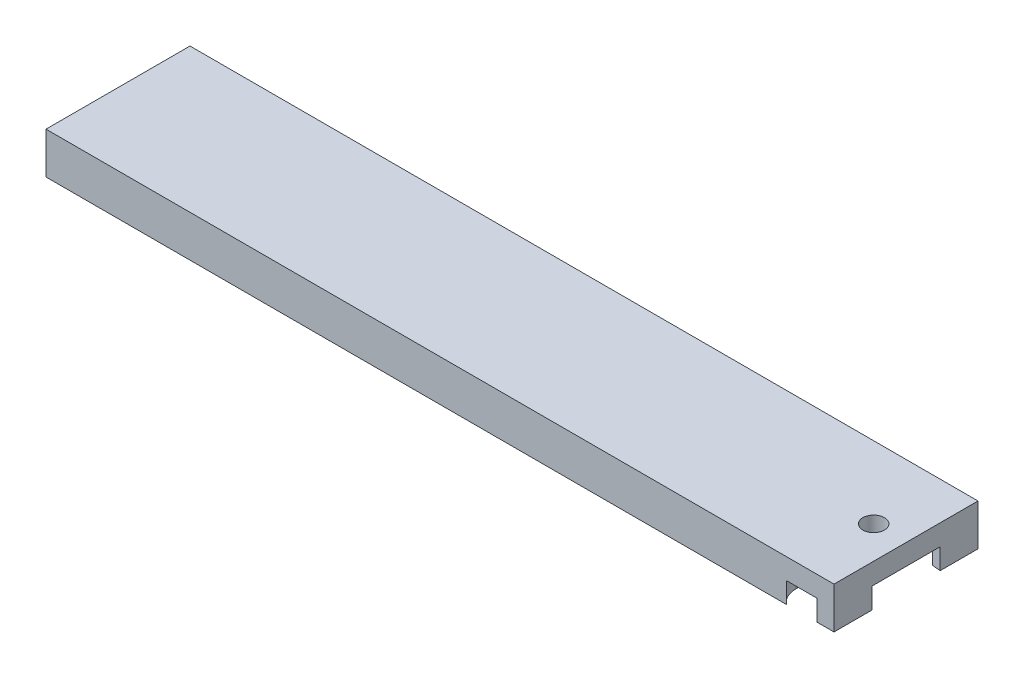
from build123d import *

# Parameters (mm, degrees)
RESSALTO_EXTRUS_O1_DEPTH = 1.4
ESBO_O2_R                = 3.45
RESSALTO_EXTRUS_O2_DEPTH = 2.4
FURO1_D                  = 1.2
PADR_O_LINEAR1_COUNT     = 6
PADR_O_LINEAR1_PITCH     = 2
RESSALTO_EXTRUS_O3_DEPTH = 1.4
FURO2_D                  = 1.2
PADR_O_LINEAR2_COUNT     = 7
PADR_O_LINEAR2_PITCH     = 2
RESSALTO_EXTRUS_O4_DEPTH = 1.4
FURO3_D                  = 1.2
PADR_O_LINEAR3_COUNT     = 2
PADR_O_LINEAR3_PITCH     = 2
PADR_OCIRCULAR1_COUNT    = 2
PADR_OCIRCULAR1_COPY_1_D = 1.2
FURO4_D                  = 4.95
FURO4_DEPTH              = 2
FURO5_D                  = 4.6
FURO5_DEPTH              = 1
FURO6_D                  = 2.1
RESSALTO_EXTRUS_O5_START = -2
RESSALTO_EXTRUS_O5_DEPTH = 2
PADR_OCIRCULAR2_COUNT    = 60
BOSS_EXTRUDE1_DEPTH      = 5
BOSS_EXTRUDE1_2_DEPTH    = 5
BOSS_EXTRUDE1_3_DEPTH    = 5
SKETCH2_W                = 100
SKETCH2_H                = 17.359649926
BOSS_EXTRUDE2_DEPTH      = 2.5
SKETCH3_R                = 1.3
CUT_EXTRUDE1_DEPTH       = 92.764859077
SKETCH4_W                = 52.17150673
SKETCH4_H                = 37.712890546
CUT_EXTRUDE2_DEPTH       = 92.649055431
CUT_EXTRUDE3_DEPTH       = 2.5
SKETCH6_W                = 5
SKETCH6_H                = 17.359649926
CUT_EXTRUDE5_DEPTH       = 10


with BuildPart() as part:
    # Esbo_o1 → Ressalto-extrus_o1 (new body)
    with BuildSketch(Plane(origin=(0, 0, 0), x_dir=(1, 0, 0), z_dir=(0, 1, 0))):
        with BuildLine():
            Line((-14.159121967, 1.99702088), (-2.209072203, 2.65))
            ThreePointArc((-2.209072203, 2.65), (3.45, 0), (-2.209072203, -2.65))
            Line((-2.209072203, -2.65), (-14.159121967, -1.99702088))
            ThreePointArc((-14.159121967, -1.99702088), (-16.05, 0), (-14.159121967, 1.99702088))
        make_face()
    extrude(amount=-RESSALTO_EXTRUS_O1_DEPTH)

    # Esbo_o2 → Ressalto-extrus_o2 (add)
    with BuildSketch(Plane.XZ.offset(1.4)):
        with Locations(Location((0, 0, 0), (0, 0, 90))):
            Circle(ESBO_O2_R)
    extrude(amount=RESSALTO_EXTRUS_O2_DEPTH)

    # Furo1 (through all)
    with Locations(Plane(origin=(0, 0, 0), x_dir=(1, 0, 0), z_dir=(0, 1, 0))):
        with Locations((-14.45, 0)):
            furo1 = Hole(FURO1_D / 2)

    # Padr_o linear1: Furo1 ×6
    with Locations(*[(i * PADR_O_LINEAR1_PITCH, 0, 0) for i in range(1, PADR_O_LINEAR1_COUNT)]):
        add(furo1, mode=Mode.SUBTRACT)

    # Esbo_o12 → Ressalto-extrus_o3 (add)
    with BuildSketch(Plane(origin=(0, 0, 0), x_dir=(1, 0, 0), z_dir=(0, 1, 0))):
        with BuildLine():
            Line((0.304103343, 3.436571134), (16.626291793, 1.99221515))
            ThreePointArc((16.626291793, 1.99221515), (18.45, 0), (16.626291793, -1.99221515))
            Line((16.626291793, -1.99221515), (0.304103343, -3.436571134))
            ThreePointArc((0.304103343, -3.436571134), (3.45, 0), (0.304103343, 3.436571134))
        make_face()
    extrude(amount=-RESSALTO_EXTRUS_O3_DEPTH)

    # Furo2 (through all)
    with Locations(Plane(origin=(0, 0, 0), x_dir=(1, 0, 0), z_dir=(0, 1, 0))):
        with Locations((16.85, 0)):
            furo2 = Hole(FURO2_D / 2)

    # Padr_o linear2: Furo2 ×7
    with Locations(*[(-i * PADR_O_LINEAR2_PITCH, 0, 0) for i in range(1, PADR_O_LINEAR2_COUNT)]):
        add(furo2, mode=Mode.SUBTRACT)

    # Esbo_o16 → Ressalto-extrus_o4 (add)
    with BuildSketch(Plane(origin=(0, 0, 0), x_dir=(1, 0, 0), z_dir=(0, 1, 0))):
        with BuildLine():
            Line((-1.9, -6.45), (-1.9, 6.45))
            ThreePointArc((-1.9, 6.45), (0, 8.35), (1.9, 6.45))
            Line((1.9, 6.45), (1.9, -6.45))
            ThreePointArc((1.9, -6.45), (0, -8.35), (-1.9, -6.45))
        make_face()
    extrude(amount=-RESSALTO_EXTRUS_O4_DEPTH)

    # Furo3 (through all)
    with Locations(Plane(origin=(0, 0, 0), x_dir=(1, 0, 0), z_dir=(0, 1, 0))):
        with Locations((0, -6.45)):
            furo3 = Hole(FURO3_D / 2)

    # Padr_o linear3: Furo3 ×2
    with Locations(*[(0, 0, -i * PADR_O_LINEAR3_PITCH) for i in range(1, PADR_O_LINEAR3_COUNT)]):
        add(furo3, mode=Mode.SUBTRACT)

    # Padr_oCircular1: Furo3 ×2 about axis
    padr_ocircular1_axis = Axis((0, 0, 0), (0, 1, 0))
    for i in range(1, PADR_OCIRCULAR1_COUNT):
        add(furo3.rotate(padr_ocircular1_axis, i * 360 / PADR_OCIRCULAR1_COUNT), mode=Mode.SUBTRACT)

    # Padr_oCircular1 copy 1 (through all)
    with Locations(Plane(origin=(0, 0, 2), x_dir=(-1, 0, 0), z_dir=(0, 1, 0))):
        with Locations((0, -6.45)):
            Hole(PADR_OCIRCULAR1_COPY_1_D / 2)

    # Furo4
    with Locations(Plane(origin=(0, -3.8, 0), x_dir=(-1, 0, 0), z_dir=(0, -1, 0))):
        with Locations((0, 0)):
            Hole(FURO4_D / 2, depth=FURO4_DEPTH)

    # Furo5
    with Locations(Plane(origin=(0, 0, 0), x_dir=(1, 0, 0), z_dir=(0, 1, 0))):
        with Locations((0, 0)):
            Hole(FURO5_D / 2, depth=FURO5_DEPTH)

    # Furo6 (through all)
    with Locations(Plane(origin=(0, 0, 0), x_dir=(1, 0, 0), z_dir=(0, 1, 0))):
        with Locations((0, 0)):
            Hole(FURO6_D / 2)

    # Esbo_o11 → Ressalto-extrus_o5 (add)
    with BuildSketch(Plane.XZ.offset(3.8).offset(RESSALTO_EXTRUS_O5_START)):
        with BuildLine():
            Line((-0.098056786, 2.473056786), (0, 2.375))
            Line((0, 2.375), (0.098056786, 2.473056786))
            ThreePointArc((0.098056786, 2.473056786), (0, 2.475), (-0.098056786, 2.473056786))
        make_face()
    ressalto_extrus_o5 = extrude(amount=RESSALTO_EXTRUS_O5_DEPTH)

    # Padr_oCircular2: Ressalto-extrus_o5 ×60 about axis
    padr_ocircular2_axis = Axis((0, 0, 0), (0, 1, 0))
    for i in range(1, PADR_OCIRCULAR2_COUNT):
        add(ressalto_extrus_o5.rotate(padr_ocircular2_axis, i * 360 / PADR_OCIRCULAR2_COUNT))


with BuildPart() as body_2:
    # Sketch1 → Boss-Extrude1 (new body)
    with BuildSketch(Plane(origin=(0, 0, 0), x_dir=(1, 0, 0), z_dir=(0, 1, 0))):
        with BuildLine():
            ThreePointArc((-2.9, 6.45), (-2.625551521, 7.681454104), (-1.854152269, 8.679824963))
            Line((-1.854152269, 8.679824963), (-91.1, 8.679824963))
            Line((-91.1, 8.679824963), (-91.1, -8.679824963))
            Line((-91.1, -8.679824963), (-1.854152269, -8.679824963))
            ThreePointArc((-1.854152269, -8.679824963), (-2.625551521, -7.681454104), (-2.9, -6.45))
            Line((-2.9, -6.45), (-2.9, -3.613737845))
            Line((-2.9, -3.613737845), (-14.213682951, -2.99553132))
            ThreePointArc((-14.213682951, -2.99553132), (-17.05, 0), (-14.213682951, 2.99553132))
            Line((-14.213682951, 2.99553132), (-2.9, 3.613737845))
            Line((-2.9, 3.613737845), (-2.9, 6.45))
        make_face()
    extrude(amount=BOSS_EXTRUDE1_DEPTH)



with BuildPart() as body_3:
    # Sketch1 → Boss-Extrude1 2 (new body)
    with BuildSketch(Plane(origin=(0, 0, 0), x_dir=(1, 0, 0), z_dir=(0, 1, 0))):
        with BuildLine():
            Line((2.9, 4.210766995), (8.9, 3.679824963))
            Line((8.9, 3.679824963), (8.9, 8.679824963))
            Line((8.9, 8.679824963), (1.854152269, 8.679824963))
            ThreePointArc((1.854152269, 8.679824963), (2.625551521, 7.681454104), (2.9, 6.45))
            Line((2.9, 6.45), (2.9, 4.210766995))
        make_face()
    extrude(amount=BOSS_EXTRUDE1_2_DEPTH)


with BuildPart() as body_4:
    # Sketch1 → Boss-Extrude1 3 (new body)
    with BuildSketch(Plane(origin=(0, 0, 0), x_dir=(1, 0, 0), z_dir=(0, 1, 0))):
        with BuildLine():
            Line((8.9, -8.679824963), (8.9, -3.679824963))
            Line((8.9, -3.679824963), (2.9, -4.210766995))
            Line((2.9, -4.210766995), (2.9, -6.45))
            ThreePointArc((2.9, -6.45), (2.625551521, -7.681454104), (1.854152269, -8.679824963))
            Line((1.854152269, -8.679824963), (8.9, -8.679824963))
        make_face()
    extrude(amount=BOSS_EXTRUDE1_3_DEPTH)


with BuildPart() as body_2_1:
    add(body_2.part)

    add(body_3.part)  # Boss-Extrude2 merges body 3

    add(body_4.part)  # Boss-Extrude2 merges body 4
    # Sketch2 → Boss-Extrude2 (add)
    with BuildSketch(Plane(origin=(0, 5, 0), x_dir=(1, 0, 0), z_dir=(0, 1, 0))):
        with Locations((-41.1, 0)):
            Rectangle(SKETCH2_W, SKETCH2_H)
    extrude(amount=-BOSS_EXTRUDE2_DEPTH)


with BuildPart() as cut_extrude1_tool:
    # Sketch3 → Cut-Extrude1 (new, through all)
    with BuildSketch(Plane.XZ.offset(1.8)):
        with Locations(Location((0, 0, 0), (0, 0, 270))):
            Circle(SKETCH3_R)
    extrude(amount=-CUT_EXTRUDE1_DEPTH)


with BuildPart() as part_1:
    add(part.part)

    # Cut-Extrude1: cut by cut_extrude1_tool
    add(cut_extrude1_tool.part, mode=Mode.SUBTRACT)

    # Sketch4 → Cut-Extrude2 (cut, through all)
    with BuildSketch(Plane.XZ):
        with Locations((5.123033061, -1.807327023)):
            Rectangle(SKETCH4_W, SKETCH4_H)
    extrude(amount=CUT_EXTRUDE2_DEPTH, mode=Mode.SUBTRACT)


with BuildPart() as body_2_2:
    add(body_2_1.part)

    # Cut-Extrude1: cut by cut_extrude1_tool
    add(cut_extrude1_tool.part, mode=Mode.SUBTRACT)

    # Sketch5 → Cut-Extrude3 (cut)
    with BuildSketch(Plane.XZ):
        with BuildLine():
            Line((-14.213682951, 2.99553132), (-21.713682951, 2.585713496))
            ThreePointArc((-21.713682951, 2.585713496), (-24.299396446, 0), (-21.713682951, -2.585713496))
            Line((-21.713682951, -2.585713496), (-14.213682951, -2.99553132))
            Line((-14.213682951, -2.99553132), (-14.213682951, 2.99553132))
        make_face()
    extrude(amount=-CUT_EXTRUDE3_DEPTH, mode=Mode.SUBTRACT)

    # Sketch6 → Cut-Extrude5 (cut)
    with BuildSketch(Plane.XZ):
        with Locations((6.4, 0)):
            Rectangle(SKETCH6_W, SKETCH6_H)
    extrude(amount=-CUT_EXTRUDE5_DEPTH, mode=Mode.SUBTRACT)


solid = body_2_2.part
